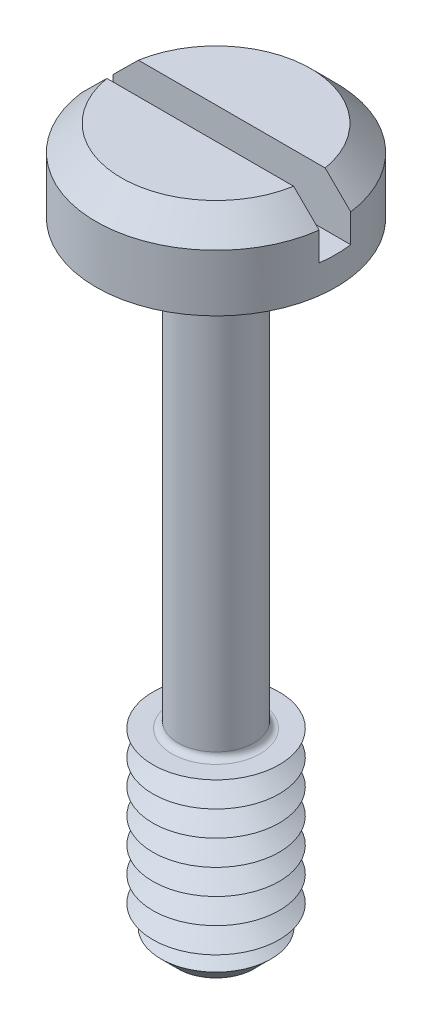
from build123d import *

# Parameters (mm, degrees)
SKETCH1_R           = 1.9
BOSS_EXTRUDE1_DEPTH = 1.3
SKETCH2_R           = 0.6
BOSS_EXTRUDE2_DEPTH = 10
SKETCH3_R           = 1
BOSS_EXTRUDE3_DEPTH = 3
CHAMFER1_SIZE       = 0.4
LPATTERN1_COUNT     = 7
LPATTERN1_PITCH     = 0.4
FILLET1_R           = 0.1
CHAMFER2_SIZE       = 0.4
SKETCH6_W           = 3.8
SKETCH6_H           = 0.5
CUT_EXTRUDE1_DEPTH  = 0.85


with BuildPart() as part:
    # Sketch1 → Boss-Extrude1 (new body)
    with BuildSketch(Plane(origin=(0, 0, 0), x_dir=(1, 0, 0), z_dir=(0, 1, 0))):
        with Locations(Location((0, 0, 0), (0, 0, 270))):
            Circle(SKETCH1_R)
    extrude(amount=BOSS_EXTRUDE1_DEPTH)

    # Sketch2 → Boss-Extrude2 (add)
    with BuildSketch(Plane.XZ):
        with Locations(Location((0, 0, 0), (0, 0, 270))):
            Circle(SKETCH2_R)
    extrude(amount=BOSS_EXTRUDE2_DEPTH)

    # Sketch3 → Boss-Extrude3 (add)
    with BuildSketch(Plane.XZ.offset(10)):
        with Locations(Location((0, 0, 0), (0, 0, 270))):
            Circle(SKETCH3_R)
    extrude(amount=-BOSS_EXTRUDE3_DEPTH)

    # Chamfer1
    chamfer1_edges = [part.edges().sort_by_distance(p)[0] for p in [
        (0, -10, 1),
    ]]
    chamfer(chamfer1_edges, length=CHAMFER1_SIZE)

    # Sketch5 → Cut-Revolve1 (revolve, cut)
    with BuildSketch(Plane(origin=(0, 0, 0), x_dir=(0, 0, -1), z_dir=(1, 0, 0))):
        Polygon((-1, -7), (-0.653589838, -7.2), (-1, -7.4), align=None)
    cut_revolve1 = revolve(axis=Axis((0, -6.58711856, 0), (0, -1, 0)), mode=Mode.SUBTRACT)

    # LPattern1: Cut-Revolve1 ×7
    with Locations(*[(0, -i * LPATTERN1_PITCH, 0) for i in range(1, LPATTERN1_COUNT)]):
        add(cut_revolve1, mode=Mode.SUBTRACT)

    # Fillet1
    fillet1_edges = [part.edges().sort_by_distance(p)[0] for p in [
        (0, 0, 0.6),
        (0, -7, 0.6),
    ]]
    fillet(fillet1_edges, radius=FILLET1_R)

    # Chamfer2
    chamfer2_edges = [part.edges().sort_by_distance(p)[0] for p in [
        (0, 1.3, -1.9),
    ]]
    chamfer(chamfer2_edges, length=CHAMFER2_SIZE)

    # Sketch6 → Cut-Extrude1 (cut)
    with BuildSketch(Plane(origin=(0, 1.3, 0), x_dir=(1, 0, 0), z_dir=(0, 1, 0))):
        Rectangle(SKETCH6_W, SKETCH6_H)
    extrude(amount=-CUT_EXTRUDE1_DEPTH, mode=Mode.SUBTRACT)


solid = part.part
